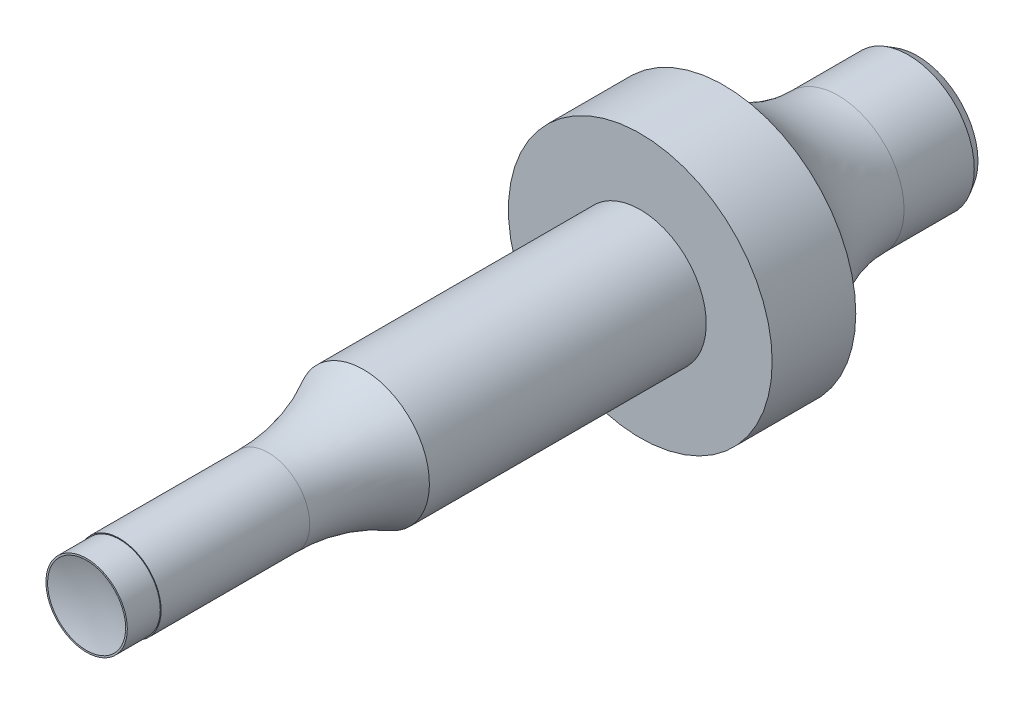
ISO-10303-21;
HEADER;
FILE_DESCRIPTION(('STEP AP214'),'2;1');
FILE_NAME('part.step','',(''),(''),'','','');
FILE_SCHEMA(('AUTOMOTIVE_DESIGN { 1 0 10303 214 1 1 1 1 }'));
ENDSEC;
DATA;
#1=APPLICATION_CONTEXT('core data for automotive mechanical design processes');
#2=APPLICATION_PROTOCOL_DEFINITION('international standard','automotive_design',2000,#1);
#3=PRODUCT_CONTEXT('',#1,'mechanical');
#4=PRODUCT('Part','Part','',(#3));
#5=PRODUCT_RELATED_PRODUCT_CATEGORY('part','',(#4));
#6=PRODUCT_DEFINITION_FORMATION('','',#4);
#7=PRODUCT_DEFINITION_CONTEXT('part definition',#1,'design');
#8=PRODUCT_DEFINITION('design','',#6,#7);
#9=PRODUCT_DEFINITION_SHAPE('','',#8);
#10=(LENGTH_UNIT() NAMED_UNIT(*) SI_UNIT(.MILLI.,.METRE.));
#11=(NAMED_UNIT(*) PLANE_ANGLE_UNIT() SI_UNIT($,.RADIAN.));
#12=(NAMED_UNIT(*) SI_UNIT($,.STERADIAN.) SOLID_ANGLE_UNIT());
#13=UNCERTAINTY_MEASURE_WITH_UNIT(LENGTH_MEASURE(1.E-05),#10,'distance_accuracy_value','');
#14=(GEOMETRIC_REPRESENTATION_CONTEXT(3) GLOBAL_UNCERTAINTY_ASSIGNED_CONTEXT((#13)) GLOBAL_UNIT_ASSIGNED_CONTEXT((#10,
#11,#12)) REPRESENTATION_CONTEXT('',''));
#15=CARTESIAN_POINT('',(0.,0.,0.));
#16=DIRECTION('',(0.,0.,1.));
#17=DIRECTION('',(1.,0.,0.));
#18=AXIS2_PLACEMENT_3D('',#15,#16,#17);
#19=CARTESIAN_POINT('',(0.,0.,-100.));
#20=DIRECTION('',(0.,0.,1.));
#21=DIRECTION('',(1.,0.,0.));
#22=AXIS2_PLACEMENT_3D('',#19,#20,#21);
#23=CYLINDRICAL_SURFACE('',#22,7.94);
#24=CARTESIAN_POINT('',(0.,0.,-33.3333333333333));
#25=DIRECTION('',(0.,0.,-1.));
#26=DIRECTION('',(0.,1.,0.));
#27=AXIS2_PLACEMENT_3D('',#24,#25,#26);
#28=CIRCLE('',#27,7.94);
#29=CARTESIAN_POINT('',(0.,7.94,-33.3333333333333));
#30=VERTEX_POINT('',#29);
#31=EDGE_CURVE('E77',#30,#30,#28,.T.);
#32=ORIENTED_EDGE('',*,*,#31,.T.);
#33=EDGE_LOOP('',(#32));
#34=FACE_BOUND('',#33,.T.);
#35=CARTESIAN_POINT('',(0.,0.,-66.6666666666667));
#36=DIRECTION('',(0.,0.,-1.));
#37=DIRECTION('',(-1.,0.,0.));
#38=AXIS2_PLACEMENT_3D('',#35,#36,#37);
#39=CIRCLE('',#38,7.94);
#40=CARTESIAN_POINT('',(-7.94,0.,-66.6666666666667));
#41=VERTEX_POINT('',#40);
#42=EDGE_CURVE('E44',#41,#41,#39,.F.);
#43=ORIENTED_EDGE('',*,*,#42,.T.);
#44=EDGE_LOOP('',(#43));
#45=FACE_BOUND('',#44,.T.);
#46=ADVANCED_FACE('F40',(#34,#45),#23,.T.);
#47=CARTESIAN_POINT('',(0.,0.,-33.3333333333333));
#48=DIRECTION('',(0.,0.,1.));
#49=DIRECTION('',(1.,0.,0.));
#50=AXIS2_PLACEMENT_3D('',#47,#48,#49);
#51=CYLINDRICAL_SURFACE('',#50,5.);
#52=CARTESIAN_POINT('',(0.,0.,-21.8695643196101));
#53=DIRECTION('',(0.,0.,1.));
#54=DIRECTION('',(0.,-1.,0.));
#55=AXIS2_PLACEMENT_3D('',#52,#53,#54);
#56=CIRCLE('',#55,5.);
#57=CARTESIAN_POINT('',(0.,-5.,-21.8695643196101));
#58=VERTEX_POINT('',#57);
#59=EDGE_CURVE('E12',#58,#58,#56,.F.);
#60=ORIENTED_EDGE('',*,*,#59,.F.);
#61=EDGE_LOOP('',(#60));
#62=FACE_BOUND('',#61,.T.);
#63=CARTESIAN_POINT('',(0.,0.,-3.97));
#64=DIRECTION('',(0.,0.,1.));
#65=DIRECTION('',(1.,0.,0.));
#66=AXIS2_PLACEMENT_3D('',#63,#64,#65);
#67=CIRCLE('',#66,5.);
#68=CARTESIAN_POINT('',(5.,0.,-3.97));
#69=VERTEX_POINT('',#68);
#70=EDGE_CURVE('E62',#69,#69,#67,.F.);
#71=ORIENTED_EDGE('',*,*,#70,.T.);
#72=EDGE_LOOP('',(#71));
#73=FACE_BOUND('',#72,.T.);
#74=ADVANCED_FACE('F106',(#62,#73),#51,.T.);
#75=CARTESIAN_POINT('',(0.,0.,-3.97));
#76=DIRECTION('',(0.,0.,1.));
#77=DIRECTION('',(1.,0.,0.));
#78=AXIS2_PLACEMENT_3D('',#75,#76,#77);
#79=PLANE('',#78);
#80=ORIENTED_EDGE('',*,*,#70,.F.);
#81=EDGE_LOOP('',(#80));
#82=FACE_BOUND('',#81,.T.);
#83=CARTESIAN_POINT('',(0.,0.,-3.97));
#84=DIRECTION('',(0.,0.,1.));
#85=DIRECTION('',(1.,0.,0.));
#86=AXIS2_PLACEMENT_3D('',#83,#84,#85);
#87=CIRCLE('',#86,4.9);
#88=CARTESIAN_POINT('',(4.9,0.,-3.97));
#89=VERTEX_POINT('',#88);
#90=EDGE_CURVE('E66',#89,#89,#87,.T.);
#91=ORIENTED_EDGE('',*,*,#90,.F.);
#92=EDGE_LOOP('',(#91));
#93=FACE_BOUND('',#92,.T.);
#94=ADVANCED_FACE('F111',(#82,#93),#79,.T.);
#95=CARTESIAN_POINT('',(0.,0.,-3.97));
#96=DIRECTION('',(0.,0.,1.));
#97=DIRECTION('',(1.,0.,0.));
#98=AXIS2_PLACEMENT_3D('',#95,#96,#97);
#99=CYLINDRICAL_SURFACE('',#98,4.9);
#100=ORIENTED_EDGE('',*,*,#90,.T.);
#101=EDGE_LOOP('',(#100));
#102=FACE_BOUND('',#101,.T.);
#103=CARTESIAN_POINT('',(0.,0.,0.));
#104=DIRECTION('',(0.,0.,1.));
#105=DIRECTION('',(1.,0.,0.));
#106=AXIS2_PLACEMENT_3D('',#103,#104,#105);
#107=CIRCLE('',#106,4.9);
#108=CARTESIAN_POINT('',(4.9,0.,0.));
#109=VERTEX_POINT('',#108);
#110=EDGE_CURVE('E67',#109,#109,#107,.T.);
#111=ORIENTED_EDGE('',*,*,#110,.F.);
#112=EDGE_LOOP('',(#111));
#113=FACE_BOUND('',#112,.T.);
#114=ADVANCED_FACE('F147',(#102,#113),#99,.T.);
#115=CARTESIAN_POINT('',(0.,0.,0.));
#116=DIRECTION('',(0.,0.,1.));
#117=DIRECTION('',(1.,0.,0.));
#118=AXIS2_PLACEMENT_3D('',#115,#116,#117);
#119=PLANE('',#118);
#120=CARTESIAN_POINT('',(0.,0.,0.));
#121=DIRECTION('',(0.,0.,1.));
#122=DIRECTION('',(0.,-1.,0.));
#123=AXIS2_PLACEMENT_3D('',#120,#121,#122);
#124=CIRCLE('',#123,4.7);
#125=CARTESIAN_POINT('',(0.,-4.7,0.));
#126=VERTEX_POINT('',#125);
#127=EDGE_CURVE('E70',#126,#126,#124,.T.);
#128=ORIENTED_EDGE('',*,*,#127,.F.);
#129=EDGE_LOOP('',(#128));
#130=FACE_BOUND('',#129,.T.);
#131=ORIENTED_EDGE('',*,*,#110,.T.);
#132=EDGE_LOOP('',(#131));
#133=FACE_BOUND('',#132,.T.);
#134=ADVANCED_FACE('F145',(#130,#133),#119,.T.);
#135=CARTESIAN_POINT('',(0.,0.,15.1685332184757));
#136=DIRECTION('',(0.,0.,1.));
#137=DIRECTION('',(0.,-1.,0.));
#138=AXIS2_PLACEMENT_3D('',#135,#136,#137);
#139=SPHERICAL_SURFACE('',#138,15.88);
#140=ORIENTED_EDGE('',*,*,#127,.T.);
#141=EDGE_LOOP('',(#140));
#142=FACE_BOUND('',#141,.T.);
#143=ADVANCED_FACE('F142',(#142),#139,.F.);
#144=CARTESIAN_POINT('',(0.,0.,-21.8695643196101));
#145=DIRECTION('',(0.,0.,-1.));
#146=DIRECTION('',(0.,1.,0.));
#147=AXIS2_PLACEMENT_3D('',#144,#145,#146);
#148=TOROIDAL_SURFACE('',#147,28.82,23.82);
#149=ORIENTED_EDGE('',*,*,#59,.T.);
#150=EDGE_LOOP('',(#149));
#151=FACE_BOUND('',#150,.T.);
#152=ORIENTED_EDGE('',*,*,#31,.F.);
#153=EDGE_LOOP('',(#152));
#154=FACE_BOUND('',#153,.T.);
#155=ADVANCED_FACE('F123',(#151,#154),#148,.F.);
#156=CARTESIAN_POINT('',(0.,0.,-66.6666666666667));
#157=DIRECTION('',(0.,0.,-1.));
#158=DIRECTION('',(-1.,0.,0.));
#159=AXIS2_PLACEMENT_3D('',#156,#157,#158);
#160=PLANE('',#159);
#161=ORIENTED_EDGE('',*,*,#42,.F.);
#162=EDGE_LOOP('',(#161));
#163=FACE_BOUND('',#162,.T.);
#164=CARTESIAN_POINT('',(0.,0.,-66.6666666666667));
#165=DIRECTION('',(0.,0.,1.));
#166=DIRECTION('',(1.,0.,0.));
#167=AXIS2_PLACEMENT_3D('',#164,#165,#166);
#168=CIRCLE('',#167,15.88);
#169=CARTESIAN_POINT('',(15.88,0.,-66.6666666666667));
#170=VERTEX_POINT('',#169);
#171=EDGE_CURVE('E81',#170,#170,#168,.T.);
#172=ORIENTED_EDGE('',*,*,#171,.T.);
#173=EDGE_LOOP('',(#172));
#174=FACE_BOUND('',#173,.T.);
#175=ADVANCED_FACE('F119',(#163,#174),#160,.F.);
#176=CARTESIAN_POINT('',(0.,0.,-66.6666666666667));
#177=DIRECTION('',(0.,0.,1.));
#178=DIRECTION('',(1.,0.,0.));
#179=AXIS2_PLACEMENT_3D('',#176,#177,#178);
#180=CYLINDRICAL_SURFACE('',#179,15.88);
#181=ORIENTED_EDGE('',*,*,#171,.F.);
#182=EDGE_LOOP('',(#181));
#183=FACE_BOUND('',#182,.T.);
#184=CARTESIAN_POINT('',(0.,0.,-76.7341832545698));
#185=DIRECTION('',(0.,0.,1.));
#186=DIRECTION('',(1.,0.,0.));
#187=AXIS2_PLACEMENT_3D('',#184,#185,#186);
#188=CIRCLE('',#187,15.88);
#189=CARTESIAN_POINT('',(15.88,0.,-76.7341832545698));
#190=VERTEX_POINT('',#189);
#191=EDGE_CURVE('E85',#190,#190,#188,.T.);
#192=ORIENTED_EDGE('',*,*,#191,.T.);
#193=EDGE_LOOP('',(#192));
#194=FACE_BOUND('',#193,.T.);
#195=ADVANCED_FACE('F122',(#183,#194),#180,.T.);
#196=CARTESIAN_POINT('',(0.,0.,-90.4866666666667));
#197=DIRECTION('',(0.,0.,1.));
#198=DIRECTION('',(1.,0.,0.));
#199=AXIS2_PLACEMENT_3D('',#196,#197,#198);
#200=TOROIDAL_SURFACE('',#199,23.82,15.88);
#201=ORIENTED_EDGE('',*,*,#191,.F.);
#202=EDGE_LOOP('',(#201));
#203=FACE_BOUND('',#202,.T.);
#204=CARTESIAN_POINT('',(0.,0.,-90.4866666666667));
#205=DIRECTION('',(0.,0.,1.));
#206=DIRECTION('',(1.,0.,0.));
#207=AXIS2_PLACEMENT_3D('',#204,#205,#206);
#208=CIRCLE('',#207,7.94);
#209=CARTESIAN_POINT('',(7.94,0.,-90.4866666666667));
#210=VERTEX_POINT('',#209);
#211=EDGE_CURVE('E89',#210,#210,#208,.T.);
#212=ORIENTED_EDGE('',*,*,#211,.T.);
#213=EDGE_LOOP('',(#212));
#214=FACE_BOUND('',#213,.T.);
#215=ADVANCED_FACE('F94',(#203,#214),#200,.F.);
#216=CARTESIAN_POINT('',(0.,0.,-100.));
#217=DIRECTION('',(0.,0.,1.));
#218=DIRECTION('',(1.,0.,0.));
#219=AXIS2_PLACEMENT_3D('',#216,#217,#218);
#220=PLANE('',#219);
#221=CARTESIAN_POINT('',(0.,0.,-100.));
#222=DIRECTION('',(0.,0.,1.));
#223=DIRECTION('',(1.,0.,0.));
#224=AXIS2_PLACEMENT_3D('',#221,#222,#223);
#225=CIRCLE('',#224,7.3287785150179);
#226=CARTESIAN_POINT('',(7.3287785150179,0.,-100.));
#227=VERTEX_POINT('',#226);
#228=EDGE_CURVE('E49',#227,#227,#225,.F.);
#229=ORIENTED_EDGE('',*,*,#228,.T.);
#230=EDGE_LOOP('',(#229));
#231=FACE_BOUND('',#230,.T.);
#232=ADVANCED_FACE('F102',(#231),#220,.F.);
#233=CARTESIAN_POINT('',(0.,0.,-98.9413333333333));
#234=DIRECTION('',(0.,0.,1.));
#235=DIRECTION('',(1.,0.,0.));
#236=AXIS2_PLACEMENT_3D('',#233,#234,#235);
#237=CONICAL_SURFACE('',#236,7.94,0.523598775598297);
#238=ORIENTED_EDGE('',*,*,#228,.F.);
#239=EDGE_LOOP('',(#238));
#240=FACE_BOUND('',#239,.T.);
#241=CARTESIAN_POINT('',(0.,0.,-98.9413333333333));
#242=DIRECTION('',(0.,0.,1.));
#243=DIRECTION('',(1.,0.,0.));
#244=AXIS2_PLACEMENT_3D('',#241,#242,#243);
#245=CIRCLE('',#244,7.94);
#246=CARTESIAN_POINT('',(7.94,0.,-98.9413333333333));
#247=VERTEX_POINT('',#246);
#248=EDGE_CURVE('E56',#247,#247,#245,.T.);
#249=ORIENTED_EDGE('',*,*,#248,.F.);
#250=EDGE_LOOP('',(#249));
#251=FACE_BOUND('',#250,.T.);
#252=ADVANCED_FACE('F42',(#240,#251),#237,.T.);
#253=ORIENTED_EDGE('',*,*,#248,.T.);
#254=EDGE_LOOP('',(#253));
#255=FACE_BOUND('',#254,.T.);
#256=ORIENTED_EDGE('',*,*,#211,.F.);
#257=EDGE_LOOP('',(#256));
#258=FACE_BOUND('',#257,.T.);
#259=ADVANCED_FACE('F96',(#255,#258),#23,.T.);
#260=CLOSED_SHELL('',(#46,#74,#94,#114,#134,#143,#155,#175,#195,#215,#232,#252,#259));
#261=MANIFOLD_SOLID_BREP('B2',#260);
#262=ADVANCED_BREP_SHAPE_REPRESENTATION('',(#18,#261),#14);
#263=SHAPE_DEFINITION_REPRESENTATION(#9,#262);
ENDSEC;
END-ISO-10303-21;
